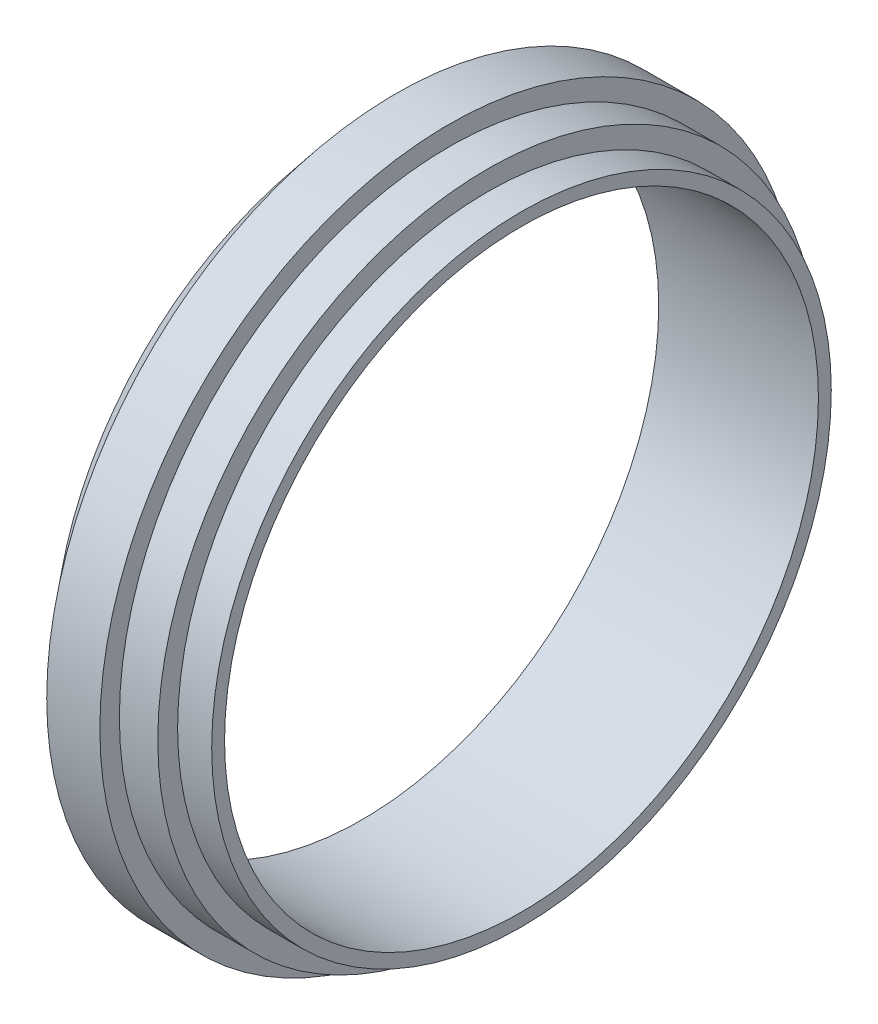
ISO-10303-21;
HEADER;
FILE_DESCRIPTION(('STEP AP214'),'2;1');
FILE_NAME('part.step','',(''),(''),'','','');
FILE_SCHEMA(('AUTOMOTIVE_DESIGN { 1 0 10303 214 1 1 1 1 }'));
ENDSEC;
DATA;
#1=APPLICATION_CONTEXT('core data for automotive mechanical design processes');
#2=APPLICATION_PROTOCOL_DEFINITION('international standard','automotive_design',2000,#1);
#3=PRODUCT_CONTEXT('',#1,'mechanical');
#4=PRODUCT('Part','Part','',(#3));
#5=PRODUCT_RELATED_PRODUCT_CATEGORY('part','',(#4));
#6=PRODUCT_DEFINITION_FORMATION('','',#4);
#7=PRODUCT_DEFINITION_CONTEXT('part definition',#1,'design');
#8=PRODUCT_DEFINITION('design','',#6,#7);
#9=PRODUCT_DEFINITION_SHAPE('','',#8);
#10=(LENGTH_UNIT() NAMED_UNIT(*) SI_UNIT(.MILLI.,.METRE.));
#11=(NAMED_UNIT(*) PLANE_ANGLE_UNIT() SI_UNIT($,.RADIAN.));
#12=(NAMED_UNIT(*) SI_UNIT($,.STERADIAN.) SOLID_ANGLE_UNIT());
#13=UNCERTAINTY_MEASURE_WITH_UNIT(LENGTH_MEASURE(1.E-05),#10,'distance_accuracy_value','');
#14=(GEOMETRIC_REPRESENTATION_CONTEXT(3) GLOBAL_UNCERTAINTY_ASSIGNED_CONTEXT((#13)) GLOBAL_UNIT_ASSIGNED_CONTEXT((#10,
#11,#12)) REPRESENTATION_CONTEXT('',''));
#15=CARTESIAN_POINT('',(0.,0.,0.));
#16=DIRECTION('',(0.,0.,1.));
#17=DIRECTION('',(1.,0.,0.));
#18=AXIS2_PLACEMENT_3D('',#15,#16,#17);
#19=CARTESIAN_POINT('',(8.88178419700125E-13,50.8,0.));
#20=DIRECTION('',(1.,0.,0.));
#21=DIRECTION('',(0.,0.,-0.999999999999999));
#22=AXIS2_PLACEMENT_3D('',#19,#20,#21);
#23=PLANE('',#22);
#24=CARTESIAN_POINT('',(8.88178419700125E-13,50.8,0.));
#25=DIRECTION('',(-1.,0.,0.));
#26=DIRECTION('',(0.,0.,0.999999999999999));
#27=AXIS2_PLACEMENT_3D('',#24,#25,#26);
#28=CIRCLE('',#27,48.6918);
#29=CARTESIAN_POINT('',(8.88178419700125E-13,50.8,48.6918));
#30=VERTEX_POINT('',#29);
#31=EDGE_CURVE('E58',#30,#30,#28,.T.);
#32=ORIENTED_EDGE('',*,*,#31,.T.);
#33=EDGE_LOOP('',(#32));
#34=FACE_BOUND('',#33,.T.);
#35=CARTESIAN_POINT('',(8.88178419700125E-13,50.8,0.));
#36=DIRECTION('',(-1.,0.,0.));
#37=DIRECTION('',(0.,0.,0.999999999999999));
#38=AXIS2_PLACEMENT_3D('',#35,#36,#37);
#39=CIRCLE('',#38,50.8);
#40=CARTESIAN_POINT('',(8.88178419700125E-13,50.8,50.7999999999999));
#41=VERTEX_POINT('',#40);
#42=EDGE_CURVE('E10',#41,#41,#39,.T.);
#43=ORIENTED_EDGE('',*,*,#42,.F.);
#44=EDGE_LOOP('',(#43));
#45=FACE_BOUND('',#44,.T.);
#46=ADVANCED_FACE('F30',(#34,#45),#23,.T.);
#47=CARTESIAN_POINT('',(-26.1873999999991,50.8,0.));
#48=DIRECTION('',(-1.,0.,0.));
#49=DIRECTION('',(0.,0.,0.999999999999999));
#50=AXIS2_PLACEMENT_3D('',#47,#48,#49);
#51=CYLINDRICAL_SURFACE('',#50,50.8);
#52=ORIENTED_EDGE('',*,*,#42,.T.);
#53=EDGE_LOOP('',(#52));
#54=FACE_BOUND('',#53,.T.);
#55=CARTESIAN_POINT('',(-5.58799999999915,50.8,-8.88178419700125E-13));
#56=DIRECTION('',(-1.,0.,0.));
#57=DIRECTION('',(0.,0.,0.999999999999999));
#58=AXIS2_PLACEMENT_3D('',#55,#56,#57);
#59=CIRCLE('',#58,50.8);
#60=CARTESIAN_POINT('',(-5.58799999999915,50.8,50.7999999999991));
#61=VERTEX_POINT('',#60);
#62=EDGE_CURVE('E36',#61,#61,#59,.T.);
#63=ORIENTED_EDGE('',*,*,#62,.F.);
#64=EDGE_LOOP('',(#63));
#65=FACE_BOUND('',#64,.T.);
#66=ADVANCED_FACE('F91',(#54,#65),#51,.T.);
#67=CARTESIAN_POINT('',(-5.58800000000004,0.,-8.88178419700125E-13));
#68=DIRECTION('',(1.,0.,0.));
#69=DIRECTION('',(0.,0.,-0.999999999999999));
#70=AXIS2_PLACEMENT_3D('',#67,#68,#69);
#71=PLANE('',#70);
#72=ORIENTED_EDGE('',*,*,#62,.T.);
#73=EDGE_LOOP('',(#72));
#74=FACE_BOUND('',#73,.T.);
#75=CARTESIAN_POINT('',(-5.58799999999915,50.8,-8.88178419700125E-13));
#76=DIRECTION('',(-1.,0.,0.));
#77=DIRECTION('',(0.,0.,0.999999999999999));
#78=AXIS2_PLACEMENT_3D('',#75,#76,#77);
#79=CIRCLE('',#78,54.0512);
#80=CARTESIAN_POINT('',(-5.58799999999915,50.8,54.0511999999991));
#81=VERTEX_POINT('',#80);
#82=EDGE_CURVE('E40',#81,#81,#79,.T.);
#83=ORIENTED_EDGE('',*,*,#82,.F.);
#84=EDGE_LOOP('',(#83));
#85=FACE_BOUND('',#84,.T.);
#86=ADVANCED_FACE('F95',(#74,#85),#71,.T.);
#87=CARTESIAN_POINT('',(-26.1873999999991,50.8,0.));
#88=DIRECTION('',(-1.,0.,0.));
#89=DIRECTION('',(0.,0.,0.999999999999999));
#90=AXIS2_PLACEMENT_3D('',#87,#88,#89);
#91=CYLINDRICAL_SURFACE('',#90,54.0512);
#92=ORIENTED_EDGE('',*,*,#82,.T.);
#93=EDGE_LOOP('',(#92));
#94=FACE_BOUND('',#93,.T.);
#95=CARTESIAN_POINT('',(-11.8871999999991,50.8,-8.88178419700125E-13));
#96=DIRECTION('',(-1.,0.,0.));
#97=DIRECTION('',(0.,0.,0.999999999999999));
#98=AXIS2_PLACEMENT_3D('',#95,#96,#97);
#99=CIRCLE('',#98,54.0512);
#100=CARTESIAN_POINT('',(-11.8871999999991,50.8,54.0511999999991));
#101=VERTEX_POINT('',#100);
#102=EDGE_CURVE('E44',#101,#101,#99,.T.);
#103=ORIENTED_EDGE('',*,*,#102,.F.);
#104=EDGE_LOOP('',(#103));
#105=FACE_BOUND('',#104,.T.);
#106=ADVANCED_FACE('F99',(#94,#105),#91,.T.);
#107=CARTESIAN_POINT('',(-11.8872,-3.25120000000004,-8.88178419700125E-13));
#108=DIRECTION('',(1.,0.,0.));
#109=DIRECTION('',(0.,0.,-0.999999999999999));
#110=AXIS2_PLACEMENT_3D('',#107,#108,#109);
#111=PLANE('',#110);
#112=ORIENTED_EDGE('',*,*,#102,.T.);
#113=EDGE_LOOP('',(#112));
#114=FACE_BOUND('',#113,.T.);
#115=CARTESIAN_POINT('',(-11.8871999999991,50.8,-8.88178419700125E-13));
#116=DIRECTION('',(-1.,0.,0.));
#117=DIRECTION('',(0.,0.,0.999999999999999));
#118=AXIS2_PLACEMENT_3D('',#115,#116,#117);
#119=CIRCLE('',#118,57.2516);
#120=CARTESIAN_POINT('',(-11.8871999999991,50.8,57.2515999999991));
#121=VERTEX_POINT('',#120);
#122=EDGE_CURVE('E49',#121,#121,#119,.T.);
#123=ORIENTED_EDGE('',*,*,#122,.F.);
#124=EDGE_LOOP('',(#123));
#125=FACE_BOUND('',#124,.T.);
#126=ADVANCED_FACE('F87',(#114,#125),#111,.T.);
#127=CARTESIAN_POINT('',(-26.1873999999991,50.8,0.));
#128=DIRECTION('',(-1.,0.,0.));
#129=DIRECTION('',(0.,0.,0.999999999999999));
#130=AXIS2_PLACEMENT_3D('',#127,#128,#129);
#131=CYLINDRICAL_SURFACE('',#130,57.2516);
#132=ORIENTED_EDGE('',*,*,#122,.T.);
#133=EDGE_LOOP('',(#132));
#134=FACE_BOUND('',#133,.T.);
#135=CARTESIAN_POINT('',(-20.5993999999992,50.8,0.));
#136=DIRECTION('',(-1.,0.,0.));
#137=DIRECTION('',(0.,0.,0.999999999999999));
#138=AXIS2_PLACEMENT_3D('',#135,#136,#137);
#139=CIRCLE('',#138,57.2516);
#140=CARTESIAN_POINT('',(-20.5993999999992,50.8,57.2516));
#141=VERTEX_POINT('',#140);
#142=EDGE_CURVE('E52',#141,#141,#139,.T.);
#143=ORIENTED_EDGE('',*,*,#142,.F.);
#144=EDGE_LOOP('',(#143));
#145=FACE_BOUND('',#144,.T.);
#146=ADVANCED_FACE('F81',(#134,#145),#131,.T.);
#147=CARTESIAN_POINT('',(-26.1873999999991,50.8,0.));
#148=DIRECTION('',(1.,0.,0.));
#149=DIRECTION('',(0.,0.,-0.999999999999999));
#150=AXIS2_PLACEMENT_3D('',#147,#148,#149);
#151=CONICAL_SURFACE('',#150,50.4952,0.879767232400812);
#152=ORIENTED_EDGE('',*,*,#142,.T.);
#153=EDGE_LOOP('',(#152));
#154=FACE_BOUND('',#153,.T.);
#155=CARTESIAN_POINT('',(-26.1873999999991,50.8,0.));
#156=DIRECTION('',(-1.,0.,0.));
#157=DIRECTION('',(0.,0.,0.999999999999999));
#158=AXIS2_PLACEMENT_3D('',#155,#156,#157);
#159=CIRCLE('',#158,50.4952);
#160=CARTESIAN_POINT('',(-26.1873999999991,50.8,50.4952));
#161=VERTEX_POINT('',#160);
#162=EDGE_CURVE('E55',#161,#161,#159,.T.);
#163=ORIENTED_EDGE('',*,*,#162,.F.);
#164=EDGE_LOOP('',(#163));
#165=FACE_BOUND('',#164,.T.);
#166=ADVANCED_FACE('F76',(#154,#165),#151,.T.);
#167=CARTESIAN_POINT('',(-26.1874,0.304799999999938,-8.88178419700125E-13));
#168=DIRECTION('',(-1.,0.,0.));
#169=DIRECTION('',(0.,0.,0.999999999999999));
#170=AXIS2_PLACEMENT_3D('',#167,#168,#169);
#171=PLANE('',#170);
#172=CARTESIAN_POINT('',(-26.1873999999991,50.8,0.));
#173=DIRECTION('',(-1.,0.,0.));
#174=DIRECTION('',(0.,0.,0.999999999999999));
#175=AXIS2_PLACEMENT_3D('',#172,#173,#174);
#176=CIRCLE('',#175,48.6918);
#177=CARTESIAN_POINT('',(-26.1873999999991,50.8,48.6918));
#178=VERTEX_POINT('',#177);
#179=EDGE_CURVE('E59',#178,#178,#176,.T.);
#180=ORIENTED_EDGE('',*,*,#179,.F.);
#181=EDGE_LOOP('',(#180));
#182=FACE_BOUND('',#181,.T.);
#183=ORIENTED_EDGE('',*,*,#162,.T.);
#184=EDGE_LOOP('',(#183));
#185=FACE_BOUND('',#184,.T.);
#186=ADVANCED_FACE('F70',(#182,#185),#171,.T.);
#187=CARTESIAN_POINT('',(8.88178419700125E-13,50.8,0.));
#188=DIRECTION('',(-1.,0.,0.));
#189=DIRECTION('',(0.,0.,0.999999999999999));
#190=AXIS2_PLACEMENT_3D('',#187,#188,#189);
#191=CYLINDRICAL_SURFACE('',#190,48.6918);
#192=ORIENTED_EDGE('',*,*,#31,.F.);
#193=EDGE_LOOP('',(#192));
#194=FACE_BOUND('',#193,.T.);
#195=ORIENTED_EDGE('',*,*,#179,.T.);
#196=EDGE_LOOP('',(#195));
#197=FACE_BOUND('',#196,.T.);
#198=ADVANCED_FACE('F67',(#194,#197),#191,.F.);
#199=CLOSED_SHELL('',(#46,#66,#86,#106,#126,#146,#166,#186,#198));
#200=MANIFOLD_SOLID_BREP('B2',#199);
#201=ADVANCED_BREP_SHAPE_REPRESENTATION('',(#18,#200),#14);
#202=SHAPE_DEFINITION_REPRESENTATION(#9,#201);
ENDSEC;
END-ISO-10303-21;
